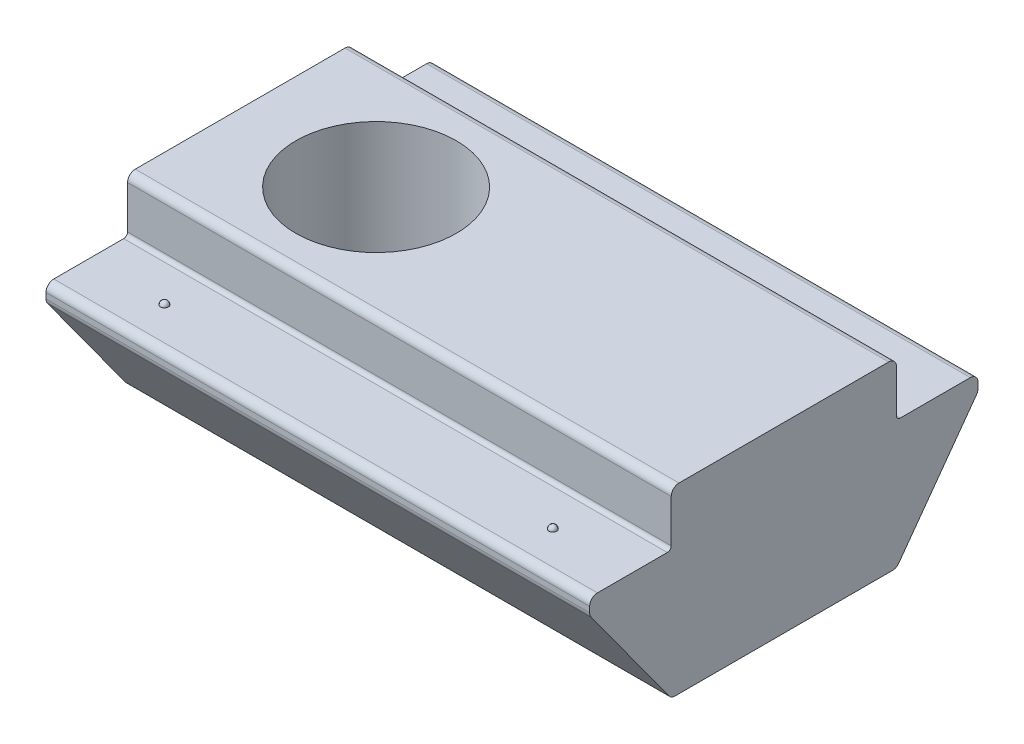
ISO-10303-21;
HEADER;
FILE_DESCRIPTION(('STEP AP214'),'2;1');
FILE_NAME('part.step','',(''),(''),'','','');
FILE_SCHEMA(('AUTOMOTIVE_DESIGN { 1 0 10303 214 1 1 1 1 }'));
ENDSEC;
DATA;
#1=APPLICATION_CONTEXT('core data for automotive mechanical design processes');
#2=APPLICATION_PROTOCOL_DEFINITION('international standard','automotive_design',2000,#1);
#3=PRODUCT_CONTEXT('',#1,'mechanical');
#4=PRODUCT('Part','Part','',(#3));
#5=PRODUCT_RELATED_PRODUCT_CATEGORY('part','',(#4));
#6=PRODUCT_DEFINITION_FORMATION('','',#4);
#7=PRODUCT_DEFINITION_CONTEXT('part definition',#1,'design');
#8=PRODUCT_DEFINITION('design','',#6,#7);
#9=PRODUCT_DEFINITION_SHAPE('','',#8);
#10=(LENGTH_UNIT() NAMED_UNIT(*) SI_UNIT(.MILLI.,.METRE.));
#11=(NAMED_UNIT(*) PLANE_ANGLE_UNIT() SI_UNIT($,.RADIAN.));
#12=(NAMED_UNIT(*) SI_UNIT($,.STERADIAN.) SOLID_ANGLE_UNIT());
#13=UNCERTAINTY_MEASURE_WITH_UNIT(LENGTH_MEASURE(1.E-05),#10,'distance_accuracy_value','');
#14=(GEOMETRIC_REPRESENTATION_CONTEXT(3) GLOBAL_UNCERTAINTY_ASSIGNED_CONTEXT((#13)) GLOBAL_UNIT_ASSIGNED_CONTEXT((#10,
#11,#12)) REPRESENTATION_CONTEXT('',''));
#15=CARTESIAN_POINT('',(0.,0.,0.));
#16=DIRECTION('',(0.,0.,1.));
#17=DIRECTION('',(1.,0.,0.));
#18=AXIS2_PLACEMENT_3D('',#15,#16,#17);
#19=CARTESIAN_POINT('',(10.5,-3.3,-2.9));
#20=DIRECTION('',(0.,1.,0.));
#21=DIRECTION('',(0.,0.,1.));
#22=AXIS2_PLACEMENT_3D('',#19,#20,#21);
#23=PLANE('',#22);
#24=CARTESIAN_POINT('',(0.,-3.3,0.));
#25=DIRECTION('',(0.,1.,0.));
#26=DIRECTION('',(0.,0.,1.));
#27=AXIS2_PLACEMENT_3D('',#24,#25,#26);
#28=CIRCLE('',#27,2.067);
#29=CARTESIAN_POINT('',(0.,-3.3,2.067));
#30=VERTEX_POINT('',#29);
#31=EDGE_CURVE('E636',#30,#30,#28,.T.);
#32=ORIENTED_EDGE('',*,*,#31,.T.);
#33=EDGE_LOOP('',(#32));
#34=FACE_BOUND('',#33,.T.);
#35=DIRECTION('',(0.,0.,-1.));
#36=VECTOR('',#35,1.);
#37=CARTESIAN_POINT('',(-3.5,-3.3,-2.9));
#38=LINE('',#37,#36);
#39=CARTESIAN_POINT('',(-3.5,-3.3,2.79809491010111));
#40=VERTEX_POINT('',#39);
#41=CARTESIAN_POINT('',(-3.5,-3.3,-2.79809491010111));
#42=VERTEX_POINT('',#41);
#43=EDGE_CURVE('E291',#40,#42,#38,.T.);
#44=ORIENTED_EDGE('',*,*,#43,.T.);
#45=DIRECTION('',(-1.,0.,0.));
#46=VECTOR('',#45,1.);
#47=CARTESIAN_POINT('',(10.5,-3.3,-2.79809491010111));
#48=LINE('',#47,#46);
#49=CARTESIAN_POINT('',(10.5,-3.3,-2.79809491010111));
#50=VERTEX_POINT('',#49);
#51=EDGE_CURVE('E11',#42,#50,#48,.F.);
#52=ORIENTED_EDGE('',*,*,#51,.T.);
#53=DIRECTION('',(0.,0.,-1.));
#54=VECTOR('',#53,1.);
#55=CARTESIAN_POINT('',(10.5,-3.3,-2.9));
#56=LINE('',#55,#54);
#57=CARTESIAN_POINT('',(10.5,-3.3,2.79809491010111));
#58=VERTEX_POINT('',#57);
#59=EDGE_CURVE('E294',#58,#50,#56,.T.);
#60=ORIENTED_EDGE('',*,*,#59,.F.);
#61=DIRECTION('',(-1.,0.,0.));
#62=VECTOR('',#61,1.);
#63=CARTESIAN_POINT('',(10.5,-3.3,2.79809491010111));
#64=LINE('',#63,#62);
#65=EDGE_CURVE('E42',#58,#40,#64,.T.);
#66=ORIENTED_EDGE('',*,*,#65,.T.);
#67=EDGE_LOOP('',(#44,#52,#60,#66));
#68=FACE_BOUND('',#67,.T.);
#69=CARTESIAN_POINT('',(7.,-3.3,0.));
#70=DIRECTION('',(0.,1.,0.));
#71=DIRECTION('',(0.,0.,1.));
#72=AXIS2_PLACEMENT_3D('',#69,#70,#71);
#73=CIRCLE('',#72,1.75);
#74=CARTESIAN_POINT('',(7.,-3.3,1.75));
#75=VERTEX_POINT('',#74);
#76=EDGE_CURVE('E329',#75,#75,#73,.T.);
#77=ORIENTED_EDGE('',*,*,#76,.T.);
#78=EDGE_LOOP('',(#77));
#79=FACE_BOUND('',#78,.T.);
#80=ADVANCED_FACE('F34',(#34,#68,#79),#23,.F.);
#81=CARTESIAN_POINT('',(10.5,0.,2.9));
#82=DIRECTION('',(0.,0.,-1.));
#83=DIRECTION('',(-1.,0.,0.));
#84=AXIS2_PLACEMENT_3D('',#81,#82,#83);
#85=PLANE('',#84);
#86=DIRECTION('',(0.,-1.,0.));
#87=VECTOR('',#86,1.);
#88=CARTESIAN_POINT('',(10.5,0.,2.9));
#89=LINE('',#88,#87);
#90=CARTESIAN_POINT('',(10.5,1.2,2.9));
#91=VERTEX_POINT('',#90);
#92=CARTESIAN_POINT('',(10.5,0.1,2.9));
#93=VERTEX_POINT('',#92);
#94=EDGE_CURVE('E203',#91,#93,#89,.T.);
#95=ORIENTED_EDGE('',*,*,#94,.F.);
#96=DIRECTION('',(-1.,0.,0.));
#97=VECTOR('',#96,1.);
#98=CARTESIAN_POINT('',(10.5,1.2,2.9));
#99=LINE('',#98,#97);
#100=CARTESIAN_POINT('',(-3.5,1.2,2.9));
#101=VERTEX_POINT('',#100);
#102=EDGE_CURVE('E258',#91,#101,#99,.T.);
#103=ORIENTED_EDGE('',*,*,#102,.T.);
#104=DIRECTION('',(0.,-1.,0.));
#105=VECTOR('',#104,1.);
#106=CARTESIAN_POINT('',(-3.5,0.,2.9));
#107=LINE('',#106,#105);
#108=CARTESIAN_POINT('',(-3.5,0.1,2.9));
#109=VERTEX_POINT('',#108);
#110=EDGE_CURVE('E326',#101,#109,#107,.T.);
#111=ORIENTED_EDGE('',*,*,#110,.T.);
#112=DIRECTION('',(-1.,0.,0.));
#113=VECTOR('',#112,1.);
#114=CARTESIAN_POINT('',(10.5,0.1,2.9));
#115=LINE('',#114,#113);
#116=EDGE_CURVE('E184',#109,#93,#115,.F.);
#117=ORIENTED_EDGE('',*,*,#116,.T.);
#118=EDGE_LOOP('',(#95,#103,#111,#117));
#119=FACE_BOUND('',#118,.T.);
#120=ADVANCED_FACE('F378',(#119),#85,.F.);
#121=CARTESIAN_POINT('',(10.5,0.,5.));
#122=DIRECTION('',(0.,-1.,0.));
#123=DIRECTION('',(0.,0.,-1.));
#124=AXIS2_PLACEMENT_3D('',#121,#122,#123);
#125=PLANE('',#124);
#126=CARTESIAN_POINT('',(8.5,0.,3.95));
#127=DIRECTION('',(0.,1.,0.));
#128=DIRECTION('',(0.,0.,1.));
#129=AXIS2_PLACEMENT_3D('',#126,#127,#128);
#130=CIRCLE('',#129,0.0999999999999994);
#131=CARTESIAN_POINT('',(8.5,0.,4.05));
#132=VERTEX_POINT('',#131);
#133=EDGE_CURVE('E646',#132,#132,#130,.T.);
#134=ORIENTED_EDGE('',*,*,#133,.F.);
#135=EDGE_LOOP('',(#134));
#136=FACE_BOUND('',#135,.T.);
#137=CARTESIAN_POINT('',(-1.5,0.,3.95));
#138=DIRECTION('',(0.,1.,0.));
#139=DIRECTION('',(0.,0.,1.));
#140=AXIS2_PLACEMENT_3D('',#137,#138,#139);
#141=CIRCLE('',#140,0.0999999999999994);
#142=CARTESIAN_POINT('',(-1.5,0.,4.05));
#143=VERTEX_POINT('',#142);
#144=EDGE_CURVE('E649',#143,#143,#141,.T.);
#145=ORIENTED_EDGE('',*,*,#144,.F.);
#146=EDGE_LOOP('',(#145));
#147=FACE_BOUND('',#146,.T.);
#148=DIRECTION('',(0.,0.,1.));
#149=VECTOR('',#148,1.);
#150=CARTESIAN_POINT('',(-3.5,0.,5.));
#151=LINE('',#150,#149);
#152=CARTESIAN_POINT('',(-3.5,0.,3.));
#153=VERTEX_POINT('',#152);
#154=CARTESIAN_POINT('',(-3.5,0.,4.8));
#155=VERTEX_POINT('',#154);
#156=EDGE_CURVE('E328',#153,#155,#151,.T.);
#157=ORIENTED_EDGE('',*,*,#156,.T.);
#158=DIRECTION('',(-1.,0.,0.));
#159=VECTOR('',#158,1.);
#160=CARTESIAN_POINT('',(10.5,0.,4.8));
#161=LINE('',#160,#159);
#162=CARTESIAN_POINT('',(10.5,0.,4.8));
#163=VERTEX_POINT('',#162);
#164=EDGE_CURVE('E273',#155,#163,#161,.F.);
#165=ORIENTED_EDGE('',*,*,#164,.T.);
#166=DIRECTION('',(0.,0.,1.));
#167=VECTOR('',#166,1.);
#168=CARTESIAN_POINT('',(10.5,0.,5.));
#169=LINE('',#168,#167);
#170=CARTESIAN_POINT('',(10.5,0.,3.));
#171=VERTEX_POINT('',#170);
#172=EDGE_CURVE('E353',#171,#163,#169,.T.);
#173=ORIENTED_EDGE('',*,*,#172,.F.);
#174=DIRECTION('',(-1.,0.,0.));
#175=VECTOR('',#174,1.);
#176=CARTESIAN_POINT('',(-3.5,0.,3.));
#177=LINE('',#176,#175);
#178=EDGE_CURVE('E210',#171,#153,#177,.T.);
#179=ORIENTED_EDGE('',*,*,#178,.T.);
#180=EDGE_LOOP('',(#157,#165,#173,#179));
#181=FACE_BOUND('',#180,.T.);
#182=ADVANCED_FACE('F384',(#136,#147,#181),#125,.F.);
#183=CARTESIAN_POINT('',(10.5,0.,5.));
#184=DIRECTION('',(0.,0.,-1.));
#185=DIRECTION('',(-1.,0.,0.));
#186=AXIS2_PLACEMENT_3D('',#183,#184,#185);
#187=PLANE('',#186);
#188=DIRECTION('',(0.,-1.,0.));
#189=VECTOR('',#188,1.);
#190=CARTESIAN_POINT('',(10.5,0.,5.));
#191=LINE('',#190,#189);
#192=CARTESIAN_POINT('',(10.5,-0.2,5.));
#193=VERTEX_POINT('',#192);
#194=CARTESIAN_POINT('',(10.5,-0.344614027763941,5.));
#195=VERTEX_POINT('',#194);
#196=EDGE_CURVE('E347',#193,#195,#191,.T.);
#197=ORIENTED_EDGE('',*,*,#196,.F.);
#198=DIRECTION('',(-1.,0.,0.));
#199=VECTOR('',#198,1.);
#200=CARTESIAN_POINT('',(10.5,-0.2,5.));
#201=LINE('',#200,#199);
#202=CARTESIAN_POINT('',(-3.5,-0.2,5.));
#203=VERTEX_POINT('',#202);
#204=EDGE_CURVE('E270',#193,#203,#201,.T.);
#205=ORIENTED_EDGE('',*,*,#204,.T.);
#206=DIRECTION('',(0.,-1.,0.));
#207=VECTOR('',#206,1.);
#208=CARTESIAN_POINT('',(-3.5,0.,5.));
#209=LINE('',#208,#207);
#210=CARTESIAN_POINT('',(-3.5,-0.344614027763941,5.));
#211=VERTEX_POINT('',#210);
#212=EDGE_CURVE('E305',#203,#211,#209,.T.);
#213=ORIENTED_EDGE('',*,*,#212,.T.);
#214=DIRECTION('',(-1.,0.,0.));
#215=VECTOR('',#214,1.);
#216=CARTESIAN_POINT('',(10.5,-0.344614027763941,5.));
#217=LINE('',#216,#215);
#218=EDGE_CURVE('E268',#211,#195,#217,.F.);
#219=ORIENTED_EDGE('',*,*,#218,.T.);
#220=EDGE_LOOP('',(#197,#205,#213,#219));
#221=FACE_BOUND('',#220,.T.);
#222=ADVANCED_FACE('F336',(#221),#187,.F.);
#223=CARTESIAN_POINT('',(10.5,-0.409597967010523,5.));
#224=DIRECTION('',(0.,0.587785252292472,-0.809016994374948));
#225=DIRECTION('',(0.,0.809016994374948,0.587785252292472));
#226=AXIS2_PLACEMENT_3D('',#223,#224,#225);
#227=PLANE('',#226);
#228=DIRECTION('',(0.,-0.809016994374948,-0.587785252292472));
#229=VECTOR('',#228,1.);
#230=CARTESIAN_POINT('',(10.5,-0.409597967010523,5.));
#231=LINE('',#230,#229);
#232=CARTESIAN_POINT('',(10.5,-0.462171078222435,4.96180339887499));
#233=VERTEX_POINT('',#232);
#234=CARTESIAN_POINT('',(10.5,-3.21755705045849,2.9598983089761));
#235=VERTEX_POINT('',#234);
#236=EDGE_CURVE('E346',#233,#235,#231,.T.);
#237=ORIENTED_EDGE('',*,*,#236,.F.);
#238=DIRECTION('',(-1.,0.,0.));
#239=VECTOR('',#238,1.);
#240=CARTESIAN_POINT('',(10.5,-0.462171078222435,4.96180339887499));
#241=LINE('',#240,#239);
#242=CARTESIAN_POINT('',(-3.5,-0.462171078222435,4.96180339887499));
#243=VERTEX_POINT('',#242);
#244=EDGE_CURVE('E282',#233,#243,#241,.T.);
#245=ORIENTED_EDGE('',*,*,#244,.T.);
#246=DIRECTION('',(0.,-0.809016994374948,-0.587785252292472));
#247=VECTOR('',#246,1.);
#248=CARTESIAN_POINT('',(-3.5,-0.409597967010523,5.));
#249=LINE('',#248,#247);
#250=CARTESIAN_POINT('',(-3.5,-3.21755705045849,2.9598983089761));
#251=VERTEX_POINT('',#250);
#252=EDGE_CURVE('E301',#243,#251,#249,.T.);
#253=ORIENTED_EDGE('',*,*,#252,.T.);
#254=DIRECTION('',(-1.,0.,0.));
#255=VECTOR('',#254,1.);
#256=CARTESIAN_POINT('',(10.5,-3.21755705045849,2.9598983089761));
#257=LINE('',#256,#255);
#258=EDGE_CURVE('E280',#251,#235,#257,.F.);
#259=ORIENTED_EDGE('',*,*,#258,.T.);
#260=EDGE_LOOP('',(#237,#245,#253,#259));
#261=FACE_BOUND('',#260,.T.);
#262=ADVANCED_FACE('F349',(#261),#227,.F.);
#263=CARTESIAN_POINT('',(10.5,-0.409597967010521,-5.));
#264=DIRECTION('',(0.,0.587785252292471,0.809016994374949));
#265=DIRECTION('',(0.,-0.809016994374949,0.587785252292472));
#266=AXIS2_PLACEMENT_3D('',#263,#264,#265);
#267=PLANE('',#266);
#268=DIRECTION('',(0.,0.809016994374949,-0.587785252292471));
#269=VECTOR('',#268,1.);
#270=CARTESIAN_POINT('',(-3.5,-0.409597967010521,-5.));
#271=LINE('',#270,#269);
#272=CARTESIAN_POINT('',(-3.5,-3.21755705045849,-2.9598983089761));
#273=VERTEX_POINT('',#272);
#274=CARTESIAN_POINT('',(-3.5,-0.462171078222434,-4.96180339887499));
#275=VERTEX_POINT('',#274);
#276=EDGE_CURVE('E300',#273,#275,#271,.T.);
#277=ORIENTED_EDGE('',*,*,#276,.T.);
#278=DIRECTION('',(-1.,0.,0.));
#279=VECTOR('',#278,1.);
#280=CARTESIAN_POINT('',(10.5,-0.462171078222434,-4.96180339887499));
#281=LINE('',#280,#279);
#282=CARTESIAN_POINT('',(10.5,-0.462171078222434,-4.96180339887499));
#283=VERTEX_POINT('',#282);
#284=EDGE_CURVE('E278',#275,#283,#281,.F.);
#285=ORIENTED_EDGE('',*,*,#284,.T.);
#286=DIRECTION('',(0.,0.809016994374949,-0.587785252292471));
#287=VECTOR('',#286,1.);
#288=CARTESIAN_POINT('',(10.5,-0.409597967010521,-5.));
#289=LINE('',#288,#287);
#290=CARTESIAN_POINT('',(10.5,-3.21755705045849,-2.9598983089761));
#291=VERTEX_POINT('',#290);
#292=EDGE_CURVE('E320',#291,#283,#289,.T.);
#293=ORIENTED_EDGE('',*,*,#292,.F.);
#294=DIRECTION('',(-1.,0.,0.));
#295=VECTOR('',#294,1.);
#296=CARTESIAN_POINT('',(10.5,-3.21755705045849,-2.9598983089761));
#297=LINE('',#296,#295);
#298=EDGE_CURVE('E275',#291,#273,#297,.T.);
#299=ORIENTED_EDGE('',*,*,#298,.T.);
#300=EDGE_LOOP('',(#277,#285,#293,#299));
#301=FACE_BOUND('',#300,.T.);
#302=ADVANCED_FACE('F365',(#301),#267,.F.);
#303=CARTESIAN_POINT('',(10.5,0.,-5.));
#304=DIRECTION('',(0.,0.,1.));
#305=DIRECTION('',(1.,0.,0.));
#306=AXIS2_PLACEMENT_3D('',#303,#304,#305);
#307=PLANE('',#306);
#308=DIRECTION('',(0.,1.,0.));
#309=VECTOR('',#308,1.);
#310=CARTESIAN_POINT('',(-3.5,0.,-5.));
#311=LINE('',#310,#309);
#312=CARTESIAN_POINT('',(-3.5,-0.34461402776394,-5.));
#313=VERTEX_POINT('',#312);
#314=CARTESIAN_POINT('',(-3.5,-0.199999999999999,-5.));
#315=VERTEX_POINT('',#314);
#316=EDGE_CURVE('E205',#313,#315,#311,.T.);
#317=ORIENTED_EDGE('',*,*,#316,.T.);
#318=DIRECTION('',(-1.,0.,0.));
#319=VECTOR('',#318,1.);
#320=CARTESIAN_POINT('',(10.5,-0.199999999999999,-5.));
#321=LINE('',#320,#319);
#322=CARTESIAN_POINT('',(10.5,-0.199999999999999,-5.));
#323=VERTEX_POINT('',#322);
#324=EDGE_CURVE('E57',#315,#323,#321,.F.);
#325=ORIENTED_EDGE('',*,*,#324,.T.);
#326=DIRECTION('',(0.,1.,0.));
#327=VECTOR('',#326,1.);
#328=CARTESIAN_POINT('',(10.5,0.,-5.));
#329=LINE('',#328,#327);
#330=CARTESIAN_POINT('',(10.5,-0.34461402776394,-5.));
#331=VERTEX_POINT('',#330);
#332=EDGE_CURVE('E317',#331,#323,#329,.T.);
#333=ORIENTED_EDGE('',*,*,#332,.F.);
#334=DIRECTION('',(-1.,0.,0.));
#335=VECTOR('',#334,1.);
#336=CARTESIAN_POINT('',(10.5,-0.34461402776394,-5.));
#337=LINE('',#336,#335);
#338=EDGE_CURVE('E264',#331,#313,#337,.T.);
#339=ORIENTED_EDGE('',*,*,#338,.T.);
#340=EDGE_LOOP('',(#317,#325,#333,#339));
#341=FACE_BOUND('',#340,.T.);
#342=ADVANCED_FACE('F309',(#341),#307,.F.);
#343=CARTESIAN_POINT('',(10.5,0.,-2.9));
#344=DIRECTION('',(0.,-1.,0.));
#345=DIRECTION('',(0.,0.,-1.));
#346=AXIS2_PLACEMENT_3D('',#343,#344,#345);
#347=PLANE('',#346);
#348=CARTESIAN_POINT('',(8.5,0.,-3.95));
#349=DIRECTION('',(0.,1.,0.));
#350=DIRECTION('',(0.,0.,1.));
#351=AXIS2_PLACEMENT_3D('',#348,#349,#350);
#352=CIRCLE('',#351,0.0999999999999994);
#353=CARTESIAN_POINT('',(8.5,0.,-3.85));
#354=VERTEX_POINT('',#353);
#355=EDGE_CURVE('E637',#354,#354,#352,.T.);
#356=ORIENTED_EDGE('',*,*,#355,.F.);
#357=EDGE_LOOP('',(#356));
#358=FACE_BOUND('',#357,.T.);
#359=CARTESIAN_POINT('',(-1.5,0.,-3.95));
#360=DIRECTION('',(0.,1.,0.));
#361=DIRECTION('',(0.,0.,1.));
#362=AXIS2_PLACEMENT_3D('',#359,#360,#361);
#363=CIRCLE('',#362,0.0999999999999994);
#364=CARTESIAN_POINT('',(-1.5,0.,-3.85));
#365=VERTEX_POINT('',#364);
#366=EDGE_CURVE('E640',#365,#365,#363,.T.);
#367=ORIENTED_EDGE('',*,*,#366,.F.);
#368=EDGE_LOOP('',(#367));
#369=FACE_BOUND('',#368,.T.);
#370=DIRECTION('',(0.,0.,1.));
#371=VECTOR('',#370,1.);
#372=CARTESIAN_POINT('',(10.5,0.,-2.9));
#373=LINE('',#372,#371);
#374=CARTESIAN_POINT('',(10.5,0.,-4.8));
#375=VERTEX_POINT('',#374);
#376=CARTESIAN_POINT('',(10.5,0.,-3.));
#377=VERTEX_POINT('',#376);
#378=EDGE_CURVE('E316',#375,#377,#373,.T.);
#379=ORIENTED_EDGE('',*,*,#378,.F.);
#380=DIRECTION('',(-1.,0.,0.));
#381=VECTOR('',#380,1.);
#382=CARTESIAN_POINT('',(10.5,0.,-4.8));
#383=LINE('',#382,#381);
#384=CARTESIAN_POINT('',(-3.5,0.,-4.8));
#385=VERTEX_POINT('',#384);
#386=EDGE_CURVE('E261',#375,#385,#383,.T.);
#387=ORIENTED_EDGE('',*,*,#386,.T.);
#388=DIRECTION('',(0.,0.,1.));
#389=VECTOR('',#388,1.);
#390=CARTESIAN_POINT('',(-3.5,0.,-2.9));
#391=LINE('',#390,#389);
#392=CARTESIAN_POINT('',(-3.5,0.,-3.));
#393=VERTEX_POINT('',#392);
#394=EDGE_CURVE('E200',#385,#393,#391,.T.);
#395=ORIENTED_EDGE('',*,*,#394,.T.);
#396=DIRECTION('',(-1.,0.,0.));
#397=VECTOR('',#396,1.);
#398=CARTESIAN_POINT('',(10.5,0.,-3.));
#399=LINE('',#398,#397);
#400=EDGE_CURVE('E179',#393,#377,#399,.F.);
#401=ORIENTED_EDGE('',*,*,#400,.T.);
#402=EDGE_LOOP('',(#379,#387,#395,#401));
#403=FACE_BOUND('',#402,.T.);
#404=ADVANCED_FACE('F315',(#358,#369,#403),#347,.F.);
#405=CARTESIAN_POINT('',(10.5,1.4,-2.9));
#406=DIRECTION('',(0.,0.,1.));
#407=DIRECTION('',(0.,-1.,0.));
#408=AXIS2_PLACEMENT_3D('',#405,#406,#407);
#409=PLANE('',#408);
#410=DIRECTION('',(0.,1.,0.));
#411=VECTOR('',#410,1.);
#412=CARTESIAN_POINT('',(-3.5,1.4,-2.9));
#413=LINE('',#412,#411);
#414=CARTESIAN_POINT('',(-3.5,0.100000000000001,-2.9));
#415=VERTEX_POINT('',#414);
#416=CARTESIAN_POINT('',(-3.5,1.2,-2.9));
#417=VERTEX_POINT('',#416);
#418=EDGE_CURVE('E190',#415,#417,#413,.T.);
#419=ORIENTED_EDGE('',*,*,#418,.T.);
#420=DIRECTION('',(-1.,0.,0.));
#421=VECTOR('',#420,1.);
#422=CARTESIAN_POINT('',(10.5,1.2,-2.9));
#423=LINE('',#422,#421);
#424=CARTESIAN_POINT('',(10.5,1.2,-2.9));
#425=VERTEX_POINT('',#424);
#426=EDGE_CURVE('E241',#417,#425,#423,.F.);
#427=ORIENTED_EDGE('',*,*,#426,.T.);
#428=DIRECTION('',(0.,1.,0.));
#429=VECTOR('',#428,1.);
#430=CARTESIAN_POINT('',(10.5,1.4,-2.9));
#431=LINE('',#430,#429);
#432=CARTESIAN_POINT('',(10.5,0.100000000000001,-2.9));
#433=VERTEX_POINT('',#432);
#434=EDGE_CURVE('E193',#433,#425,#431,.T.);
#435=ORIENTED_EDGE('',*,*,#434,.F.);
#436=DIRECTION('',(-1.,0.,0.));
#437=VECTOR('',#436,1.);
#438=CARTESIAN_POINT('',(-3.5,0.100000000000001,-2.9));
#439=LINE('',#438,#437);
#440=EDGE_CURVE('E177',#433,#415,#439,.T.);
#441=ORIENTED_EDGE('',*,*,#440,.T.);
#442=EDGE_LOOP('',(#419,#427,#435,#441));
#443=FACE_BOUND('',#442,.T.);
#444=ADVANCED_FACE('F189',(#443),#409,.F.);
#445=CARTESIAN_POINT('',(10.5,1.4,2.9));
#446=DIRECTION('',(0.,-1.,0.));
#447=DIRECTION('',(0.,0.,-1.));
#448=AXIS2_PLACEMENT_3D('',#445,#446,#447);
#449=PLANE('',#448);
#450=CARTESIAN_POINT('',(0.,1.4,0.));
#451=DIRECTION('',(0.,1.,0.));
#452=DIRECTION('',(0.,0.,1.));
#453=AXIS2_PLACEMENT_3D('',#450,#451,#452);
#454=CIRCLE('',#453,2.067);
#455=CARTESIAN_POINT('',(0.,1.4,2.067));
#456=VERTEX_POINT('',#455);
#457=EDGE_CURVE('E634',#456,#456,#454,.T.);
#458=ORIENTED_EDGE('',*,*,#457,.F.);
#459=EDGE_LOOP('',(#458));
#460=FACE_BOUND('',#459,.T.);
#461=DIRECTION('',(0.,0.,1.));
#462=VECTOR('',#461,1.);
#463=CARTESIAN_POINT('',(10.5,1.4,2.9));
#464=LINE('',#463,#462);
#465=CARTESIAN_POINT('',(10.5,1.4,-2.7));
#466=VERTEX_POINT('',#465);
#467=CARTESIAN_POINT('',(10.5,1.4,2.7));
#468=VERTEX_POINT('',#467);
#469=EDGE_CURVE('E194',#466,#468,#464,.T.);
#470=ORIENTED_EDGE('',*,*,#469,.F.);
#471=DIRECTION('',(-1.,0.,0.));
#472=VECTOR('',#471,1.);
#473=CARTESIAN_POINT('',(10.5,1.4,-2.7));
#474=LINE('',#473,#472);
#475=CARTESIAN_POINT('',(-3.5,1.4,-2.7));
#476=VERTEX_POINT('',#475);
#477=EDGE_CURVE('E223',#466,#476,#474,.T.);
#478=ORIENTED_EDGE('',*,*,#477,.T.);
#479=DIRECTION('',(0.,0.,1.));
#480=VECTOR('',#479,1.);
#481=CARTESIAN_POINT('',(-3.5,1.4,2.9));
#482=LINE('',#481,#480);
#483=CARTESIAN_POINT('',(-3.5,1.4,2.7));
#484=VERTEX_POINT('',#483);
#485=EDGE_CURVE('E199',#476,#484,#482,.T.);
#486=ORIENTED_EDGE('',*,*,#485,.T.);
#487=DIRECTION('',(-1.,0.,0.));
#488=VECTOR('',#487,1.);
#489=CARTESIAN_POINT('',(10.5,1.4,2.7));
#490=LINE('',#489,#488);
#491=EDGE_CURVE('E221',#484,#468,#490,.F.);
#492=ORIENTED_EDGE('',*,*,#491,.T.);
#493=EDGE_LOOP('',(#470,#478,#486,#492));
#494=FACE_BOUND('',#493,.T.);
#495=ADVANCED_FACE('F521',(#460,#494),#449,.F.);
#496=CARTESIAN_POINT('',(10.5,0.,0.));
#497=DIRECTION('',(-1.,0.,0.));
#498=DIRECTION('',(0.,0.,1.));
#499=AXIS2_PLACEMENT_3D('',#496,#497,#498);
#500=PLANE('',#499);
#501=ORIENTED_EDGE('',*,*,#434,.T.);
#502=CARTESIAN_POINT('',(10.5,1.2,-2.7));
#503=DIRECTION('',(-1.,0.,0.));
#504=DIRECTION('',(0.,0.,1.));
#505=AXIS2_PLACEMENT_3D('',#502,#503,#504);
#506=CIRCLE('',#505,0.2);
#507=EDGE_CURVE('E256',#425,#466,#506,.F.);
#508=ORIENTED_EDGE('',*,*,#507,.T.);
#509=ORIENTED_EDGE('',*,*,#469,.T.);
#510=CARTESIAN_POINT('',(10.5,1.2,2.7));
#511=DIRECTION('',(-1.,0.,0.));
#512=DIRECTION('',(0.,0.,1.));
#513=AXIS2_PLACEMENT_3D('',#510,#511,#512);
#514=CIRCLE('',#513,0.2);
#515=EDGE_CURVE('E254',#468,#91,#514,.F.);
#516=ORIENTED_EDGE('',*,*,#515,.T.);
#517=ORIENTED_EDGE('',*,*,#94,.T.);
#518=CARTESIAN_POINT('',(10.5,0.1,3.));
#519=DIRECTION('',(-1.,0.,0.));
#520=DIRECTION('',(0.,0.,1.));
#521=AXIS2_PLACEMENT_3D('',#518,#519,#520);
#522=CIRCLE('',#521,0.1);
#523=EDGE_CURVE('E219',#93,#171,#522,.T.);
#524=ORIENTED_EDGE('',*,*,#523,.T.);
#525=ORIENTED_EDGE('',*,*,#172,.T.);
#526=CARTESIAN_POINT('',(10.5,-0.2,4.8));
#527=DIRECTION('',(-1.,0.,0.));
#528=DIRECTION('',(0.,0.,1.));
#529=AXIS2_PLACEMENT_3D('',#526,#527,#528);
#530=CIRCLE('',#529,0.2);
#531=EDGE_CURVE('E251',#163,#193,#530,.F.);
#532=ORIENTED_EDGE('',*,*,#531,.T.);
#533=ORIENTED_EDGE('',*,*,#196,.T.);
#534=CARTESIAN_POINT('',(10.5,-0.344614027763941,4.8));
#535=DIRECTION('',(-1.,0.,0.));
#536=DIRECTION('',(0.,0.,1.));
#537=AXIS2_PLACEMENT_3D('',#534,#535,#536);
#538=CIRCLE('',#537,0.2);
#539=EDGE_CURVE('E247',#195,#233,#538,.F.);
#540=ORIENTED_EDGE('',*,*,#539,.T.);
#541=ORIENTED_EDGE('',*,*,#236,.T.);
#542=CARTESIAN_POINT('',(10.5,-3.1,2.79809491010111));
#543=DIRECTION('',(-1.,0.,0.));
#544=DIRECTION('',(0.,0.,1.));
#545=AXIS2_PLACEMENT_3D('',#542,#543,#544);
#546=CIRCLE('',#545,0.2);
#547=EDGE_CURVE('E243',#235,#58,#546,.F.);
#548=ORIENTED_EDGE('',*,*,#547,.T.);
#549=ORIENTED_EDGE('',*,*,#59,.T.);
#550=CARTESIAN_POINT('',(10.5,-3.1,-2.79809491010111));
#551=DIRECTION('',(-1.,0.,0.));
#552=DIRECTION('',(0.,0.,1.));
#553=AXIS2_PLACEMENT_3D('',#550,#551,#552);
#554=CIRCLE('',#553,0.2);
#555=EDGE_CURVE('E245',#50,#291,#554,.F.);
#556=ORIENTED_EDGE('',*,*,#555,.T.);
#557=ORIENTED_EDGE('',*,*,#292,.T.);
#558=CARTESIAN_POINT('',(10.5,-0.34461402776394,-4.8));
#559=DIRECTION('',(-1.,0.,0.));
#560=DIRECTION('',(0.,0.,1.));
#561=AXIS2_PLACEMENT_3D('',#558,#559,#560);
#562=CIRCLE('',#561,0.2);
#563=EDGE_CURVE('E249',#283,#331,#562,.F.);
#564=ORIENTED_EDGE('',*,*,#563,.T.);
#565=ORIENTED_EDGE('',*,*,#332,.T.);
#566=CARTESIAN_POINT('',(10.5,-0.199999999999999,-4.8));
#567=DIRECTION('',(-1.,0.,0.));
#568=DIRECTION('',(0.,0.,1.));
#569=AXIS2_PLACEMENT_3D('',#566,#567,#568);
#570=CIRCLE('',#569,0.2);
#571=EDGE_CURVE('E49',#323,#375,#570,.F.);
#572=ORIENTED_EDGE('',*,*,#571,.T.);
#573=ORIENTED_EDGE('',*,*,#378,.T.);
#574=CARTESIAN_POINT('',(10.5,0.100000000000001,-3.));
#575=DIRECTION('',(-1.,0.,0.));
#576=DIRECTION('',(0.,0.,1.));
#577=AXIS2_PLACEMENT_3D('',#574,#575,#576);
#578=CIRCLE('',#577,0.1);
#579=EDGE_CURVE('E183',#377,#433,#578,.T.);
#580=ORIENTED_EDGE('',*,*,#579,.T.);
#581=EDGE_LOOP('',(#501,#508,#509,#516,#517,#524,#525,#532,#533,#540,#541,#548,#549,#556,#557,
#564,#565,#572,#573,#580));
#582=FACE_BOUND('',#581,.T.);
#583=ADVANCED_FACE('F345',(#582),#500,.F.);
#584=CARTESIAN_POINT('',(-3.5,0.,0.));
#585=DIRECTION('',(-1.,0.,0.));
#586=DIRECTION('',(0.,0.,1.));
#587=AXIS2_PLACEMENT_3D('',#584,#585,#586);
#588=PLANE('',#587);
#589=ORIENTED_EDGE('',*,*,#485,.F.);
#590=CARTESIAN_POINT('',(-3.5,1.2,-2.7));
#591=DIRECTION('',(-1.,0.,0.));
#592=DIRECTION('',(0.,0.,1.));
#593=AXIS2_PLACEMENT_3D('',#590,#591,#592);
#594=CIRCLE('',#593,0.2);
#595=EDGE_CURVE('E198',#476,#417,#594,.T.);
#596=ORIENTED_EDGE('',*,*,#595,.T.);
#597=ORIENTED_EDGE('',*,*,#418,.F.);
#598=CARTESIAN_POINT('',(-3.5,0.100000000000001,-3.));
#599=DIRECTION('',(-1.,0.,0.));
#600=DIRECTION('',(0.,0.,1.));
#601=AXIS2_PLACEMENT_3D('',#598,#599,#600);
#602=CIRCLE('',#601,0.1);
#603=EDGE_CURVE('E173',#415,#393,#602,.F.);
#604=ORIENTED_EDGE('',*,*,#603,.T.);
#605=ORIENTED_EDGE('',*,*,#394,.F.);
#606=CARTESIAN_POINT('',(-3.5,-0.199999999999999,-4.8));
#607=DIRECTION('',(-1.,0.,0.));
#608=DIRECTION('',(0.,0.,1.));
#609=AXIS2_PLACEMENT_3D('',#606,#607,#608);
#610=CIRCLE('',#609,0.2);
#611=EDGE_CURVE('E236',#385,#315,#610,.T.);
#612=ORIENTED_EDGE('',*,*,#611,.T.);
#613=ORIENTED_EDGE('',*,*,#316,.F.);
#614=CARTESIAN_POINT('',(-3.5,-0.34461402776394,-4.8));
#615=DIRECTION('',(-1.,0.,0.));
#616=DIRECTION('',(0.,0.,1.));
#617=AXIS2_PLACEMENT_3D('',#614,#615,#616);
#618=CIRCLE('',#617,0.2);
#619=EDGE_CURVE('E232',#313,#275,#618,.T.);
#620=ORIENTED_EDGE('',*,*,#619,.T.);
#621=ORIENTED_EDGE('',*,*,#276,.F.);
#622=CARTESIAN_POINT('',(-3.5,-3.1,-2.79809491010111));
#623=DIRECTION('',(-1.,0.,0.));
#624=DIRECTION('',(0.,0.,1.));
#625=AXIS2_PLACEMENT_3D('',#622,#623,#624);
#626=CIRCLE('',#625,0.2);
#627=EDGE_CURVE('E228',#273,#42,#626,.T.);
#628=ORIENTED_EDGE('',*,*,#627,.T.);
#629=ORIENTED_EDGE('',*,*,#43,.F.);
#630=CARTESIAN_POINT('',(-3.5,-3.1,2.79809491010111));
#631=DIRECTION('',(-1.,0.,0.));
#632=DIRECTION('',(0.,0.,1.));
#633=AXIS2_PLACEMENT_3D('',#630,#631,#632);
#634=CIRCLE('',#633,0.2);
#635=EDGE_CURVE('E226',#40,#251,#634,.T.);
#636=ORIENTED_EDGE('',*,*,#635,.T.);
#637=ORIENTED_EDGE('',*,*,#252,.F.);
#638=CARTESIAN_POINT('',(-3.5,-0.344614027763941,4.8));
#639=DIRECTION('',(-1.,0.,0.));
#640=DIRECTION('',(0.,0.,1.));
#641=AXIS2_PLACEMENT_3D('',#638,#639,#640);
#642=CIRCLE('',#641,0.2);
#643=EDGE_CURVE('E230',#243,#211,#642,.T.);
#644=ORIENTED_EDGE('',*,*,#643,.T.);
#645=ORIENTED_EDGE('',*,*,#212,.F.);
#646=CARTESIAN_POINT('',(-3.5,-0.2,4.8));
#647=DIRECTION('',(-1.,0.,0.));
#648=DIRECTION('',(0.,0.,1.));
#649=AXIS2_PLACEMENT_3D('',#646,#647,#648);
#650=CIRCLE('',#649,0.2);
#651=EDGE_CURVE('E234',#203,#155,#650,.T.);
#652=ORIENTED_EDGE('',*,*,#651,.T.);
#653=ORIENTED_EDGE('',*,*,#156,.F.);
#654=CARTESIAN_POINT('',(-3.5,0.1,3.));
#655=DIRECTION('',(-1.,0.,0.));
#656=DIRECTION('',(0.,0.,1.));
#657=AXIS2_PLACEMENT_3D('',#654,#655,#656);
#658=CIRCLE('',#657,0.1);
#659=EDGE_CURVE('E216',#153,#109,#658,.F.);
#660=ORIENTED_EDGE('',*,*,#659,.T.);
#661=ORIENTED_EDGE('',*,*,#110,.F.);
#662=CARTESIAN_POINT('',(-3.5,1.2,2.7));
#663=DIRECTION('',(-1.,0.,0.));
#664=DIRECTION('',(0.,0.,1.));
#665=AXIS2_PLACEMENT_3D('',#662,#663,#664);
#666=CIRCLE('',#665,0.2);
#667=EDGE_CURVE('E238',#101,#484,#666,.T.);
#668=ORIENTED_EDGE('',*,*,#667,.T.);
#669=EDGE_LOOP('',(#589,#596,#597,#604,#605,#612,#613,#620,#621,#628,#629,#636,#637,#644,#645,
#652,#653,#660,#661,#668));
#670=FACE_BOUND('',#669,.T.);
#671=ADVANCED_FACE('F197',(#670),#588,.T.);
#672=CARTESIAN_POINT('',(10.5,0.100000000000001,-3.));
#673=DIRECTION('',(1.,0.,0.));
#674=DIRECTION('',(0.,0.,-1.));
#675=AXIS2_PLACEMENT_3D('',#672,#673,#674);
#676=CYLINDRICAL_SURFACE('',#675,0.1);
#677=ORIENTED_EDGE('',*,*,#579,.F.);
#678=ORIENTED_EDGE('',*,*,#400,.F.);
#679=ORIENTED_EDGE('',*,*,#603,.F.);
#680=ORIENTED_EDGE('',*,*,#440,.F.);
#681=EDGE_LOOP('',(#677,#678,#679,#680));
#682=FACE_BOUND('',#681,.T.);
#683=ADVANCED_FACE('F176',(#682),#676,.F.);
#684=CARTESIAN_POINT('',(10.5,0.1,3.));
#685=DIRECTION('',(1.,0.,0.));
#686=DIRECTION('',(0.,0.,-1.));
#687=AXIS2_PLACEMENT_3D('',#684,#685,#686);
#688=CYLINDRICAL_SURFACE('',#687,0.1);
#689=ORIENTED_EDGE('',*,*,#523,.F.);
#690=ORIENTED_EDGE('',*,*,#116,.F.);
#691=ORIENTED_EDGE('',*,*,#659,.F.);
#692=ORIENTED_EDGE('',*,*,#178,.F.);
#693=EDGE_LOOP('',(#689,#690,#691,#692));
#694=FACE_BOUND('',#693,.T.);
#695=ADVANCED_FACE('F400',(#694),#688,.F.);
#696=CARTESIAN_POINT('',(10.5,1.2,-2.7));
#697=DIRECTION('',(-1.,0.,0.));
#698=DIRECTION('',(0.,0.,1.));
#699=AXIS2_PLACEMENT_3D('',#696,#697,#698);
#700=CYLINDRICAL_SURFACE('',#699,0.2);
#701=ORIENTED_EDGE('',*,*,#507,.F.);
#702=ORIENTED_EDGE('',*,*,#426,.F.);
#703=ORIENTED_EDGE('',*,*,#595,.F.);
#704=ORIENTED_EDGE('',*,*,#477,.F.);
#705=EDGE_LOOP('',(#701,#702,#703,#704));
#706=FACE_BOUND('',#705,.T.);
#707=ADVANCED_FACE('F403',(#706),#700,.T.);
#708=CARTESIAN_POINT('',(10.5,1.2,2.7));
#709=DIRECTION('',(-1.,0.,0.));
#710=DIRECTION('',(0.,0.,1.));
#711=AXIS2_PLACEMENT_3D('',#708,#709,#710);
#712=CYLINDRICAL_SURFACE('',#711,0.2);
#713=ORIENTED_EDGE('',*,*,#515,.F.);
#714=ORIENTED_EDGE('',*,*,#491,.F.);
#715=ORIENTED_EDGE('',*,*,#667,.F.);
#716=ORIENTED_EDGE('',*,*,#102,.F.);
#717=EDGE_LOOP('',(#713,#714,#715,#716));
#718=FACE_BOUND('',#717,.T.);
#719=ADVANCED_FACE('F407',(#718),#712,.T.);
#720=CARTESIAN_POINT('',(10.5,-0.199999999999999,-4.8));
#721=DIRECTION('',(-1.,0.,0.));
#722=DIRECTION('',(0.,0.,1.));
#723=AXIS2_PLACEMENT_3D('',#720,#721,#722);
#724=CYLINDRICAL_SURFACE('',#723,0.2);
#725=ORIENTED_EDGE('',*,*,#571,.F.);
#726=ORIENTED_EDGE('',*,*,#324,.F.);
#727=ORIENTED_EDGE('',*,*,#611,.F.);
#728=ORIENTED_EDGE('',*,*,#386,.F.);
#729=EDGE_LOOP('',(#725,#726,#727,#728));
#730=FACE_BOUND('',#729,.T.);
#731=ADVANCED_FACE('F312',(#730),#724,.T.);
#732=CARTESIAN_POINT('',(10.5,-0.2,4.8));
#733=DIRECTION('',(-1.,0.,0.));
#734=DIRECTION('',(0.,0.,1.));
#735=AXIS2_PLACEMENT_3D('',#732,#733,#734);
#736=CYLINDRICAL_SURFACE('',#735,0.2);
#737=ORIENTED_EDGE('',*,*,#531,.F.);
#738=ORIENTED_EDGE('',*,*,#164,.F.);
#739=ORIENTED_EDGE('',*,*,#651,.F.);
#740=ORIENTED_EDGE('',*,*,#204,.F.);
#741=EDGE_LOOP('',(#737,#738,#739,#740));
#742=FACE_BOUND('',#741,.T.);
#743=ADVANCED_FACE('F414',(#742),#736,.T.);
#744=CARTESIAN_POINT('',(10.5,-0.34461402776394,-4.8));
#745=DIRECTION('',(-1.,0.,0.));
#746=DIRECTION('',(0.,0.,1.));
#747=AXIS2_PLACEMENT_3D('',#744,#745,#746);
#748=CYLINDRICAL_SURFACE('',#747,0.2);
#749=ORIENTED_EDGE('',*,*,#563,.F.);
#750=ORIENTED_EDGE('',*,*,#284,.F.);
#751=ORIENTED_EDGE('',*,*,#619,.F.);
#752=ORIENTED_EDGE('',*,*,#338,.F.);
#753=EDGE_LOOP('',(#749,#750,#751,#752));
#754=FACE_BOUND('',#753,.T.);
#755=ADVANCED_FACE('F364',(#754),#748,.T.);
#756=CARTESIAN_POINT('',(10.5,-0.344614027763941,4.8));
#757=DIRECTION('',(-1.,0.,0.));
#758=DIRECTION('',(0.,0.,1.));
#759=AXIS2_PLACEMENT_3D('',#756,#757,#758);
#760=CYLINDRICAL_SURFACE('',#759,0.2);
#761=ORIENTED_EDGE('',*,*,#539,.F.);
#762=ORIENTED_EDGE('',*,*,#218,.F.);
#763=ORIENTED_EDGE('',*,*,#643,.F.);
#764=ORIENTED_EDGE('',*,*,#244,.F.);
#765=EDGE_LOOP('',(#761,#762,#763,#764));
#766=FACE_BOUND('',#765,.T.);
#767=ADVANCED_FACE('F341',(#766),#760,.T.);
#768=CARTESIAN_POINT('',(10.5,-3.1,-2.79809491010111));
#769=DIRECTION('',(-1.,0.,0.));
#770=DIRECTION('',(0.,0.,1.));
#771=AXIS2_PLACEMENT_3D('',#768,#769,#770);
#772=CYLINDRICAL_SURFACE('',#771,0.2);
#773=ORIENTED_EDGE('',*,*,#555,.F.);
#774=ORIENTED_EDGE('',*,*,#51,.F.);
#775=ORIENTED_EDGE('',*,*,#627,.F.);
#776=ORIENTED_EDGE('',*,*,#298,.F.);
#777=EDGE_LOOP('',(#773,#774,#775,#776));
#778=FACE_BOUND('',#777,.T.);
#779=ADVANCED_FACE('F367',(#778),#772,.T.);
#780=CARTESIAN_POINT('',(10.5,-3.1,2.79809491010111));
#781=DIRECTION('',(-1.,0.,0.));
#782=DIRECTION('',(0.,0.,1.));
#783=AXIS2_PLACEMENT_3D('',#780,#781,#782);
#784=CYLINDRICAL_SURFACE('',#783,0.2);
#785=ORIENTED_EDGE('',*,*,#547,.F.);
#786=ORIENTED_EDGE('',*,*,#258,.F.);
#787=ORIENTED_EDGE('',*,*,#635,.F.);
#788=ORIENTED_EDGE('',*,*,#65,.F.);
#789=EDGE_LOOP('',(#785,#786,#787,#788));
#790=FACE_BOUND('',#789,.T.);
#791=ADVANCED_FACE('F36',(#790),#784,.T.);
#792=CARTESIAN_POINT('',(7.,0.,0.));
#793=DIRECTION('',(0.,1.,0.));
#794=DIRECTION('',(0.,0.,1.));
#795=AXIS2_PLACEMENT_3D('',#792,#793,#794);
#796=CYLINDRICAL_SURFACE('',#795,1.75);
#797=CARTESIAN_POINT('',(7.,-2.25,0.));
#798=DIRECTION('',(0.,1.,0.));
#799=DIRECTION('',(0.,0.,1.));
#800=AXIS2_PLACEMENT_3D('',#797,#798,#799);
#801=CIRCLE('',#800,1.75);
#802=CARTESIAN_POINT('',(7.,-2.25,1.75));
#803=VERTEX_POINT('',#802);
#804=EDGE_CURVE('E652',#803,#803,#801,.T.);
#805=ORIENTED_EDGE('',*,*,#804,.T.);
#806=EDGE_LOOP('',(#805));
#807=FACE_BOUND('',#806,.T.);
#808=ORIENTED_EDGE('',*,*,#76,.F.);
#809=EDGE_LOOP('',(#808));
#810=FACE_BOUND('',#809,.T.);
#811=ADVANCED_FACE('F369',(#807,#810),#796,.F.);
#812=CARTESIAN_POINT('',(7.,-2.25,0.));
#813=DIRECTION('',(0.,1.,0.));
#814=DIRECTION('',(0.,0.,1.));
#815=AXIS2_PLACEMENT_3D('',#812,#813,#814);
#816=SPHERICAL_SURFACE('',#815,1.75);
#817=ORIENTED_EDGE('',*,*,#804,.F.);
#818=EDGE_LOOP('',(#817));
#819=FACE_BOUND('',#818,.T.);
#820=ADVANCED_FACE('F374',(#819),#816,.T.);
#821=CARTESIAN_POINT('',(-1.5,0.,3.95));
#822=DIRECTION('',(0.,1.,0.));
#823=DIRECTION('',(0.,0.,-1.));
#824=AXIS2_PLACEMENT_3D('',#821,#822,#823);
#825=SPHERICAL_SURFACE('',#824,0.0999999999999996);
#826=ORIENTED_EDGE('',*,*,#144,.T.);
#827=EDGE_LOOP('',(#826));
#828=FACE_BOUND('',#827,.T.);
#829=ADVANCED_FACE('F449',(#828),#825,.T.);
#830=CARTESIAN_POINT('',(8.5,0.,3.95));
#831=DIRECTION('',(0.,1.,0.));
#832=DIRECTION('',(0.,0.,-1.));
#833=AXIS2_PLACEMENT_3D('',#830,#831,#832);
#834=SPHERICAL_SURFACE('',#833,0.0999999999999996);
#835=ORIENTED_EDGE('',*,*,#133,.T.);
#836=EDGE_LOOP('',(#835));
#837=FACE_BOUND('',#836,.T.);
#838=ADVANCED_FACE('F459',(#837),#834,.T.);
#839=CARTESIAN_POINT('',(-1.5,0.,-3.95));
#840=DIRECTION('',(0.,1.,0.));
#841=DIRECTION('',(0.,0.,-1.));
#842=AXIS2_PLACEMENT_3D('',#839,#840,#841);
#843=SPHERICAL_SURFACE('',#842,0.0999999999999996);
#844=ORIENTED_EDGE('',*,*,#366,.T.);
#845=EDGE_LOOP('',(#844));
#846=FACE_BOUND('',#845,.T.);
#847=ADVANCED_FACE('F490',(#846),#843,.T.);
#848=CARTESIAN_POINT('',(8.5,0.,-3.95));
#849=DIRECTION('',(0.,1.,0.));
#850=DIRECTION('',(0.,0.,-1.));
#851=AXIS2_PLACEMENT_3D('',#848,#849,#850);
#852=SPHERICAL_SURFACE('',#851,0.0999999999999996);
#853=ORIENTED_EDGE('',*,*,#355,.T.);
#854=EDGE_LOOP('',(#853));
#855=FACE_BOUND('',#854,.T.);
#856=ADVANCED_FACE('F500',(#855),#852,.T.);
#857=CARTESIAN_POINT('',(0.,1.4,0.));
#858=DIRECTION('',(0.,1.,0.));
#859=DIRECTION('',(0.,0.,1.));
#860=AXIS2_PLACEMENT_3D('',#857,#858,#859);
#861=CYLINDRICAL_SURFACE('',#860,2.067);
#862=ORIENTED_EDGE('',*,*,#457,.T.);
#863=EDGE_LOOP('',(#862));
#864=FACE_BOUND('',#863,.T.);
#865=ORIENTED_EDGE('',*,*,#31,.F.);
#866=EDGE_LOOP('',(#865));
#867=FACE_BOUND('',#866,.T.);
#868=ADVANCED_FACE('F509',(#864,#867),#861,.F.);
#869=CLOSED_SHELL('',(#80,#120,#182,#222,#262,#302,#342,#404,#444,#495,#583,#671,#683,#695,#707,
#719,#731,#743,#755,#767,#779,#791,#811,#820,#829,#838,#847,#856,#868));
#870=MANIFOLD_SOLID_BREP('B2',#869);
#871=ADVANCED_BREP_SHAPE_REPRESENTATION('',(#18,#870),#14);
#872=SHAPE_DEFINITION_REPRESENTATION(#9,#871);
ENDSEC;
END-ISO-10303-21;
